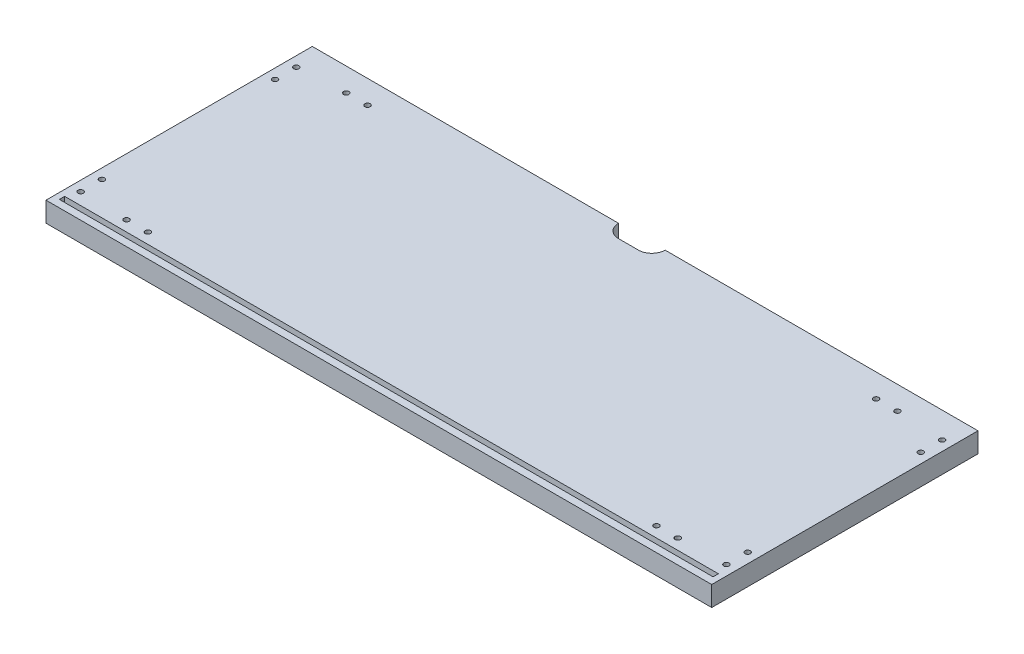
ISO-10303-21;
HEADER;
FILE_DESCRIPTION(('STEP AP214'),'2;1');
FILE_NAME('part.step','',(''),(''),'','','');
FILE_SCHEMA(('AUTOMOTIVE_DESIGN { 1 0 10303 214 1 1 1 1 }'));
ENDSEC;
DATA;
#1=APPLICATION_CONTEXT('core data for automotive mechanical design processes');
#2=APPLICATION_PROTOCOL_DEFINITION('international standard','automotive_design',2000,#1);
#3=PRODUCT_CONTEXT('',#1,'mechanical');
#4=PRODUCT('Part','Part','',(#3));
#5=PRODUCT_RELATED_PRODUCT_CATEGORY('part','',(#4));
#6=PRODUCT_DEFINITION_FORMATION('','',#4);
#7=PRODUCT_DEFINITION_CONTEXT('part definition',#1,'design');
#8=PRODUCT_DEFINITION('design','',#6,#7);
#9=PRODUCT_DEFINITION_SHAPE('','',#8);
#10=(LENGTH_UNIT() NAMED_UNIT(*) SI_UNIT(.MILLI.,.METRE.));
#11=(NAMED_UNIT(*) PLANE_ANGLE_UNIT() SI_UNIT($,.RADIAN.));
#12=(NAMED_UNIT(*) SI_UNIT($,.STERADIAN.) SOLID_ANGLE_UNIT());
#13=UNCERTAINTY_MEASURE_WITH_UNIT(LENGTH_MEASURE(1.E-05),#10,'distance_accuracy_value','');
#14=(GEOMETRIC_REPRESENTATION_CONTEXT(3) GLOBAL_UNCERTAINTY_ASSIGNED_CONTEXT((#13)) GLOBAL_UNIT_ASSIGNED_CONTEXT((#10,
#11,#12)) REPRESENTATION_CONTEXT('',''));
#15=CARTESIAN_POINT('',(0.,0.,0.));
#16=DIRECTION('',(0.,0.,1.));
#17=DIRECTION('',(1.,0.,0.));
#18=AXIS2_PLACEMENT_3D('',#15,#16,#17);
#19=CARTESIAN_POINT('',(-500.,30.,-200.));
#20=DIRECTION('',(0.,0.,1.));
#21=DIRECTION('',(1.,0.,0.));
#22=AXIS2_PLACEMENT_3D('',#19,#20,#21);
#23=PLANE('',#22);
#24=DIRECTION('',(-1.,0.,0.));
#25=VECTOR('',#24,1.);
#26=CARTESIAN_POINT('',(-500.,30.,-200.));
#27=LINE('',#26,#25);
#28=CARTESIAN_POINT('',(-40.,30.,-200.));
#29=VERTEX_POINT('',#28);
#30=CARTESIAN_POINT('',(-500.,30.,-200.));
#31=VERTEX_POINT('',#30);
#32=EDGE_CURVE('E194',#29,#31,#27,.T.);
#33=ORIENTED_EDGE('',*,*,#32,.F.);
#34=DIRECTION('',(0.,1.,0.));
#35=VECTOR('',#34,1.);
#36=CARTESIAN_POINT('',(-40.,0.,-200.));
#37=LINE('',#36,#35);
#38=CARTESIAN_POINT('',(-40.,0.,-200.));
#39=VERTEX_POINT('',#38);
#40=EDGE_CURVE('E154',#39,#29,#37,.T.);
#41=ORIENTED_EDGE('',*,*,#40,.F.);
#42=DIRECTION('',(-1.,0.,0.));
#43=VECTOR('',#42,1.);
#44=CARTESIAN_POINT('',(-500.,0.,-200.));
#45=LINE('',#44,#43);
#46=CARTESIAN_POINT('',(-500.,0.,-200.));
#47=VERTEX_POINT('',#46);
#48=EDGE_CURVE('E141',#39,#47,#45,.T.);
#49=ORIENTED_EDGE('',*,*,#48,.T.);
#50=DIRECTION('',(0.,-1.,0.));
#51=VECTOR('',#50,1.);
#52=CARTESIAN_POINT('',(-500.,30.,-200.));
#53=LINE('',#52,#51);
#54=EDGE_CURVE('E40',#31,#47,#53,.T.);
#55=ORIENTED_EDGE('',*,*,#54,.F.);
#56=EDGE_LOOP('',(#33,#41,#49,#55));
#57=FACE_BOUND('',#56,.T.);
#58=ADVANCED_FACE('F32',(#57),#23,.F.);
#59=CARTESIAN_POINT('',(500.,30.,200.));
#60=DIRECTION('',(-1.,0.,0.));
#61=DIRECTION('',(0.,0.,1.));
#62=AXIS2_PLACEMENT_3D('',#59,#60,#61);
#63=PLANE('',#62);
#64=DIRECTION('',(0.,0.,-1.));
#65=VECTOR('',#64,1.);
#66=CARTESIAN_POINT('',(500.,0.,200.));
#67=LINE('',#66,#65);
#68=CARTESIAN_POINT('',(500.,0.,200.));
#69=VERTEX_POINT('',#68);
#70=CARTESIAN_POINT('',(500.,0.,-200.));
#71=VERTEX_POINT('',#70);
#72=EDGE_CURVE('E185',#69,#71,#67,.T.);
#73=ORIENTED_EDGE('',*,*,#72,.T.);
#74=DIRECTION('',(0.,-1.,0.));
#75=VECTOR('',#74,1.);
#76=CARTESIAN_POINT('',(500.,30.,-200.));
#77=LINE('',#76,#75);
#78=CARTESIAN_POINT('',(500.,30.,-200.));
#79=VERTEX_POINT('',#78);
#80=EDGE_CURVE('E11',#79,#71,#77,.T.);
#81=ORIENTED_EDGE('',*,*,#80,.F.);
#82=DIRECTION('',(0.,0.,-1.));
#83=VECTOR('',#82,1.);
#84=CARTESIAN_POINT('',(500.,30.,200.));
#85=LINE('',#84,#83);
#86=CARTESIAN_POINT('',(500.,30.,200.));
#87=VERTEX_POINT('',#86);
#88=EDGE_CURVE('E191',#87,#79,#85,.T.);
#89=ORIENTED_EDGE('',*,*,#88,.F.);
#90=DIRECTION('',(0.,-1.,0.));
#91=VECTOR('',#90,1.);
#92=CARTESIAN_POINT('',(500.,30.,200.));
#93=LINE('',#92,#91);
#94=EDGE_CURVE('E203',#87,#69,#93,.T.);
#95=ORIENTED_EDGE('',*,*,#94,.T.);
#96=EDGE_LOOP('',(#73,#81,#89,#95));
#97=FACE_BOUND('',#96,.T.);
#98=ADVANCED_FACE('F34',(#97),#63,.F.);
#99=CARTESIAN_POINT('',(30.,0.,-200.));
#100=VERTEX_POINT('',#99);
#101=EDGE_CURVE('E206',#71,#100,#45,.T.);
#102=ORIENTED_EDGE('',*,*,#101,.T.);
#103=DIRECTION('',(0.,1.,0.));
#104=VECTOR('',#103,1.);
#105=CARTESIAN_POINT('',(30.,0.,-200.));
#106=LINE('',#105,#104);
#107=CARTESIAN_POINT('',(30.,30.,-200.));
#108=VERTEX_POINT('',#107);
#109=EDGE_CURVE('E156',#100,#108,#106,.T.);
#110=ORIENTED_EDGE('',*,*,#109,.T.);
#111=EDGE_CURVE('E196',#79,#108,#27,.T.);
#112=ORIENTED_EDGE('',*,*,#111,.F.);
#113=ORIENTED_EDGE('',*,*,#80,.T.);
#114=EDGE_LOOP('',(#102,#110,#112,#113));
#115=FACE_BOUND('',#114,.T.);
#116=ADVANCED_FACE('F237',(#115),#23,.F.);
#117=CARTESIAN_POINT('',(-500.,30.,200.));
#118=DIRECTION('',(1.,0.,0.));
#119=DIRECTION('',(0.,0.,-1.));
#120=AXIS2_PLACEMENT_3D('',#117,#118,#119);
#121=PLANE('',#120);
#122=DIRECTION('',(0.,0.,1.));
#123=VECTOR('',#122,1.);
#124=CARTESIAN_POINT('',(-500.,0.,200.));
#125=LINE('',#124,#123);
#126=CARTESIAN_POINT('',(-500.,0.,200.));
#127=VERTEX_POINT('',#126);
#128=EDGE_CURVE('E209',#47,#127,#125,.T.);
#129=ORIENTED_EDGE('',*,*,#128,.T.);
#130=DIRECTION('',(0.,-1.,0.));
#131=VECTOR('',#130,1.);
#132=CARTESIAN_POINT('',(-500.,30.,200.));
#133=LINE('',#132,#131);
#134=CARTESIAN_POINT('',(-500.,30.,200.));
#135=VERTEX_POINT('',#134);
#136=EDGE_CURVE('E214',#135,#127,#133,.T.);
#137=ORIENTED_EDGE('',*,*,#136,.F.);
#138=DIRECTION('',(0.,0.,1.));
#139=VECTOR('',#138,1.);
#140=CARTESIAN_POINT('',(-500.,30.,200.));
#141=LINE('',#140,#139);
#142=EDGE_CURVE('E199',#31,#135,#141,.T.);
#143=ORIENTED_EDGE('',*,*,#142,.F.);
#144=ORIENTED_EDGE('',*,*,#54,.T.);
#145=EDGE_LOOP('',(#129,#137,#143,#144));
#146=FACE_BOUND('',#145,.T.);
#147=ADVANCED_FACE('F220',(#146),#121,.F.);
#148=CARTESIAN_POINT('',(-500.,30.,200.));
#149=DIRECTION('',(0.,0.,-1.));
#150=DIRECTION('',(-1.,0.,0.));
#151=AXIS2_PLACEMENT_3D('',#148,#149,#150);
#152=PLANE('',#151);
#153=DIRECTION('',(1.,0.,0.));
#154=VECTOR('',#153,1.);
#155=CARTESIAN_POINT('',(-500.,0.,200.));
#156=LINE('',#155,#154);
#157=EDGE_CURVE('E195',#127,#69,#156,.T.);
#158=ORIENTED_EDGE('',*,*,#157,.T.);
#159=ORIENTED_EDGE('',*,*,#94,.F.);
#160=DIRECTION('',(1.,0.,0.));
#161=VECTOR('',#160,1.);
#162=CARTESIAN_POINT('',(-500.,30.,200.));
#163=LINE('',#162,#161);
#164=EDGE_CURVE('E201',#135,#87,#163,.T.);
#165=ORIENTED_EDGE('',*,*,#164,.F.);
#166=ORIENTED_EDGE('',*,*,#136,.T.);
#167=EDGE_LOOP('',(#158,#159,#165,#166));
#168=FACE_BOUND('',#167,.T.);
#169=ADVANCED_FACE('F228',(#168),#152,.F.);
#170=CARTESIAN_POINT('',(0.,30.,0.));
#171=DIRECTION('',(0.,-1.,0.));
#172=DIRECTION('',(0.,0.,-1.));
#173=AXIS2_PLACEMENT_3D('',#170,#171,#172);
#174=PLANE('',#173);
#175=CARTESIAN_POINT('',(485.,30.,163.));
#176=DIRECTION('',(0.,-1.,0.));
#177=DIRECTION('',(0.,0.,1.));
#178=AXIS2_PLACEMENT_3D('',#175,#176,#177);
#179=CIRCLE('',#178,3.99999999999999);
#180=CARTESIAN_POINT('',(485.,30.,167.));
#181=VERTEX_POINT('',#180);
#182=EDGE_CURVE('E580',#181,#181,#179,.T.);
#183=ORIENTED_EDGE('',*,*,#182,.T.);
#184=EDGE_LOOP('',(#183));
#185=FACE_BOUND('',#184,.T.);
#186=CARTESIAN_POINT('',(485.,30.,-129.));
#187=DIRECTION('',(0.,-1.,0.));
#188=DIRECTION('',(0.,0.,1.));
#189=AXIS2_PLACEMENT_3D('',#186,#187,#188);
#190=CIRCLE('',#189,3.99999999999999);
#191=CARTESIAN_POINT('',(485.,30.,-125.));
#192=VERTEX_POINT('',#191);
#193=EDGE_CURVE('E593',#192,#192,#190,.T.);
#194=ORIENTED_EDGE('',*,*,#193,.T.);
#195=EDGE_LOOP('',(#194));
#196=FACE_BOUND('',#195,.T.);
#197=CARTESIAN_POINT('',(485.,30.,-161.));
#198=DIRECTION('',(0.,-1.,0.));
#199=DIRECTION('',(0.,0.,1.));
#200=AXIS2_PLACEMENT_3D('',#197,#198,#199);
#201=CIRCLE('',#200,3.99999999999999);
#202=CARTESIAN_POINT('',(485.,30.,-157.));
#203=VERTEX_POINT('',#202);
#204=EDGE_CURVE('E592',#203,#203,#201,.T.);
#205=ORIENTED_EDGE('',*,*,#204,.T.);
#206=EDGE_LOOP('',(#205));
#207=FACE_BOUND('',#206,.T.);
#208=CARTESIAN_POINT('',(485.,30.,131.));
#209=DIRECTION('',(0.,-1.,0.));
#210=DIRECTION('',(0.,0.,1.));
#211=AXIS2_PLACEMENT_3D('',#208,#209,#210);
#212=CIRCLE('',#211,3.99999999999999);
#213=CARTESIAN_POINT('',(485.,30.,135.));
#214=VERTEX_POINT('',#213);
#215=EDGE_CURVE('E598',#214,#214,#212,.T.);
#216=ORIENTED_EDGE('',*,*,#215,.T.);
#217=EDGE_LOOP('',(#216));
#218=FACE_BOUND('',#217,.T.);
#219=CARTESIAN_POINT('',(382.,30.,-165.));
#220=DIRECTION('',(0.,-1.,0.));
#221=DIRECTION('',(0.,0.,1.));
#222=AXIS2_PLACEMENT_3D('',#219,#220,#221);
#223=CIRCLE('',#222,3.99999999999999);
#224=CARTESIAN_POINT('',(382.,30.,-161.));
#225=VERTEX_POINT('',#224);
#226=EDGE_CURVE('E579',#225,#225,#223,.T.);
#227=ORIENTED_EDGE('',*,*,#226,.T.);
#228=EDGE_LOOP('',(#227));
#229=FACE_BOUND('',#228,.T.);
#230=CARTESIAN_POINT('',(414.,30.,-165.));
#231=DIRECTION('',(0.,-1.,0.));
#232=DIRECTION('',(0.,0.,1.));
#233=AXIS2_PLACEMENT_3D('',#230,#231,#232);
#234=CIRCLE('',#233,3.99999999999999);
#235=CARTESIAN_POINT('',(414.,30.,-161.));
#236=VERTEX_POINT('',#235);
#237=EDGE_CURVE('E616',#236,#236,#234,.T.);
#238=ORIENTED_EDGE('',*,*,#237,.T.);
#239=EDGE_LOOP('',(#238));
#240=FACE_BOUND('',#239,.T.);
#241=CARTESIAN_POINT('',(414.,30.,165.));
#242=DIRECTION('',(0.,-1.,0.));
#243=DIRECTION('',(0.,0.,1.));
#244=AXIS2_PLACEMENT_3D('',#241,#242,#243);
#245=CIRCLE('',#244,3.99999999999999);
#246=CARTESIAN_POINT('',(414.,30.,169.));
#247=VERTEX_POINT('',#246);
#248=EDGE_CURVE('E610',#247,#247,#245,.T.);
#249=ORIENTED_EDGE('',*,*,#248,.T.);
#250=EDGE_LOOP('',(#249));
#251=FACE_BOUND('',#250,.T.);
#252=CARTESIAN_POINT('',(382.,30.,165.));
#253=DIRECTION('',(0.,-1.,0.));
#254=DIRECTION('',(0.,0.,1.));
#255=AXIS2_PLACEMENT_3D('',#252,#253,#254);
#256=CIRCLE('',#255,3.99999999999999);
#257=CARTESIAN_POINT('',(382.,30.,169.));
#258=VERTEX_POINT('',#257);
#259=EDGE_CURVE('E609',#258,#258,#256,.T.);
#260=ORIENTED_EDGE('',*,*,#259,.T.);
#261=EDGE_LOOP('',(#260));
#262=FACE_BOUND('',#261,.T.);
#263=CARTESIAN_POINT('',(-485.,30.,163.));
#264=DIRECTION('',(0.,1.,0.));
#265=DIRECTION('',(0.,0.,1.));
#266=AXIS2_PLACEMENT_3D('',#263,#264,#265);
#267=CIRCLE('',#266,3.99999999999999);
#268=CARTESIAN_POINT('',(-485.,30.,167.));
#269=VERTEX_POINT('',#268);
#270=EDGE_CURVE('E631',#269,#269,#267,.T.);
#271=ORIENTED_EDGE('',*,*,#270,.F.);
#272=EDGE_LOOP('',(#271));
#273=FACE_BOUND('',#272,.T.);
#274=CARTESIAN_POINT('',(-485.,30.,-129.));
#275=DIRECTION('',(0.,1.,0.));
#276=DIRECTION('',(0.,0.,1.));
#277=AXIS2_PLACEMENT_3D('',#274,#275,#276);
#278=CIRCLE('',#277,3.99999999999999);
#279=CARTESIAN_POINT('',(-485.,30.,-125.));
#280=VERTEX_POINT('',#279);
#281=EDGE_CURVE('E624',#280,#280,#278,.T.);
#282=ORIENTED_EDGE('',*,*,#281,.F.);
#283=EDGE_LOOP('',(#282));
#284=FACE_BOUND('',#283,.T.);
#285=CARTESIAN_POINT('',(-485.,30.,-161.));
#286=DIRECTION('',(0.,1.,0.));
#287=DIRECTION('',(0.,0.,1.));
#288=AXIS2_PLACEMENT_3D('',#285,#286,#287);
#289=CIRCLE('',#288,3.99999999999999);
#290=CARTESIAN_POINT('',(-485.,30.,-157.));
#291=VERTEX_POINT('',#290);
#292=EDGE_CURVE('E638',#291,#291,#289,.T.);
#293=ORIENTED_EDGE('',*,*,#292,.F.);
#294=EDGE_LOOP('',(#293));
#295=FACE_BOUND('',#294,.T.);
#296=CARTESIAN_POINT('',(-485.,30.,131.));
#297=DIRECTION('',(0.,1.,0.));
#298=DIRECTION('',(0.,0.,1.));
#299=AXIS2_PLACEMENT_3D('',#296,#297,#298);
#300=CIRCLE('',#299,3.99999999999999);
#301=CARTESIAN_POINT('',(-485.,30.,135.));
#302=VERTEX_POINT('',#301);
#303=EDGE_CURVE('E643',#302,#302,#300,.T.);
#304=ORIENTED_EDGE('',*,*,#303,.F.);
#305=EDGE_LOOP('',(#304));
#306=FACE_BOUND('',#305,.T.);
#307=CARTESIAN_POINT('',(-382.,30.,-165.));
#308=DIRECTION('',(0.,1.,0.));
#309=DIRECTION('',(0.,0.,1.));
#310=AXIS2_PLACEMENT_3D('',#307,#308,#309);
#311=CIRCLE('',#310,3.99999999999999);
#312=CARTESIAN_POINT('',(-382.,30.,-161.));
#313=VERTEX_POINT('',#312);
#314=EDGE_CURVE('E630',#313,#313,#311,.T.);
#315=ORIENTED_EDGE('',*,*,#314,.F.);
#316=EDGE_LOOP('',(#315));
#317=FACE_BOUND('',#316,.T.);
#318=CARTESIAN_POINT('',(-414.,30.,-165.));
#319=DIRECTION('',(0.,1.,0.));
#320=DIRECTION('',(0.,0.,1.));
#321=AXIS2_PLACEMENT_3D('',#318,#319,#320);
#322=CIRCLE('',#321,3.99999999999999);
#323=CARTESIAN_POINT('',(-414.,30.,-161.));
#324=VERTEX_POINT('',#323);
#325=EDGE_CURVE('E660',#324,#324,#322,.T.);
#326=ORIENTED_EDGE('',*,*,#325,.F.);
#327=EDGE_LOOP('',(#326));
#328=FACE_BOUND('',#327,.T.);
#329=CARTESIAN_POINT('',(-414.,30.,165.));
#330=DIRECTION('',(0.,1.,0.));
#331=DIRECTION('',(0.,0.,1.));
#332=AXIS2_PLACEMENT_3D('',#329,#330,#331);
#333=CIRCLE('',#332,3.99999999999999);
#334=CARTESIAN_POINT('',(-414.,30.,169.));
#335=VERTEX_POINT('',#334);
#336=EDGE_CURVE('E654',#335,#335,#333,.T.);
#337=ORIENTED_EDGE('',*,*,#336,.F.);
#338=EDGE_LOOP('',(#337));
#339=FACE_BOUND('',#338,.T.);
#340=CARTESIAN_POINT('',(-382.,30.,165.));
#341=DIRECTION('',(0.,1.,0.));
#342=DIRECTION('',(0.,0.,1.));
#343=AXIS2_PLACEMENT_3D('',#340,#341,#342);
#344=CIRCLE('',#343,3.99999999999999);
#345=CARTESIAN_POINT('',(-382.,30.,169.));
#346=VERTEX_POINT('',#345);
#347=EDGE_CURVE('E147',#346,#346,#344,.T.);
#348=ORIENTED_EDGE('',*,*,#347,.F.);
#349=EDGE_LOOP('',(#348));
#350=FACE_BOUND('',#349,.T.);
#351=DIRECTION('',(1.,0.,0.));
#352=VECTOR('',#351,1.);
#353=CARTESIAN_POINT('',(-491.,30.,189.));
#354=LINE('',#353,#352);
#355=CARTESIAN_POINT('',(-491.,30.,189.));
#356=VERTEX_POINT('',#355);
#357=CARTESIAN_POINT('',(491.,30.,189.));
#358=VERTEX_POINT('',#357);
#359=EDGE_CURVE('E175',#356,#358,#354,.T.);
#360=ORIENTED_EDGE('',*,*,#359,.F.);
#361=DIRECTION('',(0.,0.,1.));
#362=VECTOR('',#361,1.);
#363=CARTESIAN_POINT('',(-491.,30.,181.));
#364=LINE('',#363,#362);
#365=CARTESIAN_POINT('',(-491.,30.,181.));
#366=VERTEX_POINT('',#365);
#367=EDGE_CURVE('E55',#366,#356,#364,.T.);
#368=ORIENTED_EDGE('',*,*,#367,.F.);
#369=DIRECTION('',(-1.,0.,0.));
#370=VECTOR('',#369,1.);
#371=CARTESIAN_POINT('',(-491.,30.,181.));
#372=LINE('',#371,#370);
#373=CARTESIAN_POINT('',(491.,30.,181.));
#374=VERTEX_POINT('',#373);
#375=EDGE_CURVE('E164',#374,#366,#372,.T.);
#376=ORIENTED_EDGE('',*,*,#375,.F.);
#377=DIRECTION('',(0.,0.,-1.));
#378=VECTOR('',#377,1.);
#379=CARTESIAN_POINT('',(491.,30.,181.));
#380=LINE('',#379,#378);
#381=EDGE_CURVE('E178',#358,#374,#380,.T.);
#382=ORIENTED_EDGE('',*,*,#381,.F.);
#383=EDGE_LOOP('',(#360,#368,#376,#382));
#384=FACE_BOUND('',#383,.T.);
#385=DIRECTION('',(1.,0.,0.));
#386=VECTOR('',#385,1.);
#387=CARTESIAN_POINT('',(-20.,30.,-180.));
#388=LINE('',#387,#386);
#389=CARTESIAN_POINT('',(-20.,30.,-180.));
#390=VERTEX_POINT('',#389);
#391=CARTESIAN_POINT('',(10.,30.,-180.));
#392=VERTEX_POINT('',#391);
#393=EDGE_CURVE('E144',#390,#392,#388,.T.);
#394=ORIENTED_EDGE('',*,*,#393,.F.);
#395=CARTESIAN_POINT('',(-20.,30.,-200.));
#396=DIRECTION('',(0.,1.,0.));
#397=DIRECTION('',(0.,0.,1.));
#398=AXIS2_PLACEMENT_3D('',#395,#396,#397);
#399=CIRCLE('',#398,20.);
#400=EDGE_CURVE('E127',#29,#390,#399,.T.);
#401=ORIENTED_EDGE('',*,*,#400,.F.);
#402=ORIENTED_EDGE('',*,*,#32,.T.);
#403=ORIENTED_EDGE('',*,*,#142,.T.);
#404=ORIENTED_EDGE('',*,*,#164,.T.);
#405=ORIENTED_EDGE('',*,*,#88,.T.);
#406=ORIENTED_EDGE('',*,*,#111,.T.);
#407=CARTESIAN_POINT('',(10.,30.,-200.));
#408=DIRECTION('',(0.,1.,0.));
#409=DIRECTION('',(0.,0.,1.));
#410=AXIS2_PLACEMENT_3D('',#407,#408,#409);
#411=CIRCLE('',#410,20.);
#412=EDGE_CURVE('E142',#392,#108,#411,.T.);
#413=ORIENTED_EDGE('',*,*,#412,.F.);
#414=EDGE_LOOP('',(#394,#401,#402,#403,#404,#405,#406,#413));
#415=FACE_BOUND('',#414,.T.);
#416=ADVANCED_FACE('F234',(#185,#196,#207,#218,#229,#240,#251,#262,#273,#284,#295,#306,#317,
#328,#339,#350,#384,#415),#174,.F.);
#417=CARTESIAN_POINT('',(0.,0.,0.));
#418=DIRECTION('',(0.,-1.,0.));
#419=DIRECTION('',(0.,0.,-1.));
#420=AXIS2_PLACEMENT_3D('',#417,#418,#419);
#421=PLANE('',#420);
#422=CARTESIAN_POINT('',(382.,0.,-165.));
#423=DIRECTION('',(0.,-1.,0.));
#424=DIRECTION('',(0.,0.,1.));
#425=AXIS2_PLACEMENT_3D('',#422,#423,#424);
#426=CIRCLE('',#425,3.99999999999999);
#427=CARTESIAN_POINT('',(382.,0.,-161.));
#428=VERTEX_POINT('',#427);
#429=EDGE_CURVE('E583',#428,#428,#426,.T.);
#430=ORIENTED_EDGE('',*,*,#429,.F.);
#431=EDGE_LOOP('',(#430));
#432=FACE_BOUND('',#431,.T.);
#433=CARTESIAN_POINT('',(414.,0.,-165.));
#434=DIRECTION('',(0.,-1.,0.));
#435=DIRECTION('',(0.,0.,1.));
#436=AXIS2_PLACEMENT_3D('',#433,#434,#435);
#437=CIRCLE('',#436,3.99999999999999);
#438=CARTESIAN_POINT('',(414.,0.,-161.));
#439=VERTEX_POINT('',#438);
#440=EDGE_CURVE('E613',#439,#439,#437,.T.);
#441=ORIENTED_EDGE('',*,*,#440,.F.);
#442=EDGE_LOOP('',(#441));
#443=FACE_BOUND('',#442,.T.);
#444=CARTESIAN_POINT('',(414.,0.,165.));
#445=DIRECTION('',(0.,-1.,0.));
#446=DIRECTION('',(0.,0.,1.));
#447=AXIS2_PLACEMENT_3D('',#444,#445,#446);
#448=CIRCLE('',#447,3.99999999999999);
#449=CARTESIAN_POINT('',(414.,0.,169.));
#450=VERTEX_POINT('',#449);
#451=EDGE_CURVE('E606',#450,#450,#448,.T.);
#452=ORIENTED_EDGE('',*,*,#451,.F.);
#453=EDGE_LOOP('',(#452));
#454=FACE_BOUND('',#453,.T.);
#455=CARTESIAN_POINT('',(382.,0.,165.));
#456=DIRECTION('',(0.,-1.,0.));
#457=DIRECTION('',(0.,0.,1.));
#458=AXIS2_PLACEMENT_3D('',#455,#456,#457);
#459=CIRCLE('',#458,3.99999999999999);
#460=CARTESIAN_POINT('',(382.,0.,169.));
#461=VERTEX_POINT('',#460);
#462=EDGE_CURVE('E621',#461,#461,#459,.T.);
#463=ORIENTED_EDGE('',*,*,#462,.F.);
#464=EDGE_LOOP('',(#463));
#465=FACE_BOUND('',#464,.T.);
#466=CARTESIAN_POINT('',(-382.,0.,-165.));
#467=DIRECTION('',(0.,1.,0.));
#468=DIRECTION('',(0.,0.,1.));
#469=AXIS2_PLACEMENT_3D('',#466,#467,#468);
#470=CIRCLE('',#469,3.99999999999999);
#471=CARTESIAN_POINT('',(-382.,0.,-161.));
#472=VERTEX_POINT('',#471);
#473=EDGE_CURVE('E663',#472,#472,#470,.T.);
#474=ORIENTED_EDGE('',*,*,#473,.T.);
#475=EDGE_LOOP('',(#474));
#476=FACE_BOUND('',#475,.T.);
#477=CARTESIAN_POINT('',(-414.,0.,-165.));
#478=DIRECTION('',(0.,1.,0.));
#479=DIRECTION('',(0.,0.,1.));
#480=AXIS2_PLACEMENT_3D('',#477,#478,#479);
#481=CIRCLE('',#480,3.99999999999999);
#482=CARTESIAN_POINT('',(-414.,0.,-161.));
#483=VERTEX_POINT('',#482);
#484=EDGE_CURVE('E657',#483,#483,#481,.T.);
#485=ORIENTED_EDGE('',*,*,#484,.T.);
#486=EDGE_LOOP('',(#485));
#487=FACE_BOUND('',#486,.T.);
#488=CARTESIAN_POINT('',(-414.,0.,165.));
#489=DIRECTION('',(0.,1.,0.));
#490=DIRECTION('',(0.,0.,1.));
#491=AXIS2_PLACEMENT_3D('',#488,#489,#490);
#492=CIRCLE('',#491,3.99999999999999);
#493=CARTESIAN_POINT('',(-414.,0.,169.));
#494=VERTEX_POINT('',#493);
#495=EDGE_CURVE('E651',#494,#494,#492,.T.);
#496=ORIENTED_EDGE('',*,*,#495,.T.);
#497=EDGE_LOOP('',(#496));
#498=FACE_BOUND('',#497,.T.);
#499=CARTESIAN_POINT('',(-382.,0.,165.));
#500=DIRECTION('',(0.,1.,0.));
#501=DIRECTION('',(0.,0.,1.));
#502=AXIS2_PLACEMENT_3D('',#499,#500,#501);
#503=CIRCLE('',#502,3.99999999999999);
#504=CARTESIAN_POINT('',(-382.,0.,169.));
#505=VERTEX_POINT('',#504);
#506=EDGE_CURVE('E152',#505,#505,#503,.T.);
#507=ORIENTED_EDGE('',*,*,#506,.T.);
#508=EDGE_LOOP('',(#507));
#509=FACE_BOUND('',#508,.T.);
#510=CARTESIAN_POINT('',(-20.,0.,-200.));
#511=DIRECTION('',(0.,1.,0.));
#512=DIRECTION('',(0.,0.,1.));
#513=AXIS2_PLACEMENT_3D('',#510,#511,#512);
#514=CIRCLE('',#513,20.);
#515=CARTESIAN_POINT('',(-20.,0.,-180.));
#516=VERTEX_POINT('',#515);
#517=EDGE_CURVE('E124',#39,#516,#514,.T.);
#518=ORIENTED_EDGE('',*,*,#517,.T.);
#519=DIRECTION('',(1.,0.,0.));
#520=VECTOR('',#519,1.);
#521=CARTESIAN_POINT('',(-20.,0.,-180.));
#522=LINE('',#521,#520);
#523=CARTESIAN_POINT('',(10.,0.,-180.));
#524=VERTEX_POINT('',#523);
#525=EDGE_CURVE('E134',#516,#524,#522,.T.);
#526=ORIENTED_EDGE('',*,*,#525,.T.);
#527=CARTESIAN_POINT('',(10.,0.,-200.));
#528=DIRECTION('',(0.,1.,0.));
#529=DIRECTION('',(0.,0.,1.));
#530=AXIS2_PLACEMENT_3D('',#527,#528,#529);
#531=CIRCLE('',#530,20.);
#532=EDGE_CURVE('E47',#524,#100,#531,.T.);
#533=ORIENTED_EDGE('',*,*,#532,.T.);
#534=ORIENTED_EDGE('',*,*,#101,.F.);
#535=ORIENTED_EDGE('',*,*,#72,.F.);
#536=ORIENTED_EDGE('',*,*,#157,.F.);
#537=ORIENTED_EDGE('',*,*,#128,.F.);
#538=ORIENTED_EDGE('',*,*,#48,.F.);
#539=EDGE_LOOP('',(#518,#526,#533,#534,#535,#536,#537,#538));
#540=FACE_BOUND('',#539,.T.);
#541=ADVANCED_FACE('F139',(#432,#443,#454,#465,#476,#487,#498,#509,#540),#421,.T.);
#542=CARTESIAN_POINT('',(-491.,21.,181.));
#543=DIRECTION('',(-1.,0.,0.));
#544=DIRECTION('',(0.,0.,1.));
#545=AXIS2_PLACEMENT_3D('',#542,#543,#544);
#546=PLANE('',#545);
#547=ORIENTED_EDGE('',*,*,#367,.T.);
#548=DIRECTION('',(0.,1.,0.));
#549=VECTOR('',#548,1.);
#550=CARTESIAN_POINT('',(-491.,21.,189.));
#551=LINE('',#550,#549);
#552=CARTESIAN_POINT('',(-491.,21.,189.));
#553=VERTEX_POINT('',#552);
#554=EDGE_CURVE('E173',#553,#356,#551,.T.);
#555=ORIENTED_EDGE('',*,*,#554,.F.);
#556=DIRECTION('',(0.,0.,1.));
#557=VECTOR('',#556,1.);
#558=CARTESIAN_POINT('',(-491.,21.,181.));
#559=LINE('',#558,#557);
#560=CARTESIAN_POINT('',(-491.,21.,181.));
#561=VERTEX_POINT('',#560);
#562=EDGE_CURVE('E160',#561,#553,#559,.T.);
#563=ORIENTED_EDGE('',*,*,#562,.F.);
#564=DIRECTION('',(0.,1.,0.));
#565=VECTOR('',#564,1.);
#566=CARTESIAN_POINT('',(-491.,21.,181.));
#567=LINE('',#566,#565);
#568=EDGE_CURVE('E183',#561,#366,#567,.T.);
#569=ORIENTED_EDGE('',*,*,#568,.T.);
#570=EDGE_LOOP('',(#547,#555,#563,#569));
#571=FACE_BOUND('',#570,.T.);
#572=ADVANCED_FACE('F269',(#571),#546,.F.);
#573=CARTESIAN_POINT('',(-491.,21.,181.));
#574=DIRECTION('',(0.,0.,-1.));
#575=DIRECTION('',(-1.,0.,0.));
#576=AXIS2_PLACEMENT_3D('',#573,#574,#575);
#577=PLANE('',#576);
#578=ORIENTED_EDGE('',*,*,#375,.T.);
#579=ORIENTED_EDGE('',*,*,#568,.F.);
#580=DIRECTION('',(-1.,0.,0.));
#581=VECTOR('',#580,1.);
#582=CARTESIAN_POINT('',(-491.,21.,181.));
#583=LINE('',#582,#581);
#584=CARTESIAN_POINT('',(491.,21.,181.));
#585=VERTEX_POINT('',#584);
#586=EDGE_CURVE('E170',#585,#561,#583,.T.);
#587=ORIENTED_EDGE('',*,*,#586,.F.);
#588=DIRECTION('',(0.,1.,0.));
#589=VECTOR('',#588,1.);
#590=CARTESIAN_POINT('',(491.,21.,181.));
#591=LINE('',#590,#589);
#592=EDGE_CURVE('E186',#585,#374,#591,.T.);
#593=ORIENTED_EDGE('',*,*,#592,.T.);
#594=EDGE_LOOP('',(#578,#579,#587,#593));
#595=FACE_BOUND('',#594,.T.);
#596=ADVANCED_FACE('F265',(#595),#577,.F.);
#597=CARTESIAN_POINT('',(491.,21.,181.));
#598=DIRECTION('',(1.,0.,0.));
#599=DIRECTION('',(0.,0.,-1.));
#600=AXIS2_PLACEMENT_3D('',#597,#598,#599);
#601=PLANE('',#600);
#602=ORIENTED_EDGE('',*,*,#381,.T.);
#603=ORIENTED_EDGE('',*,*,#592,.F.);
#604=DIRECTION('',(0.,0.,-1.));
#605=VECTOR('',#604,1.);
#606=CARTESIAN_POINT('',(491.,21.,181.));
#607=LINE('',#606,#605);
#608=CARTESIAN_POINT('',(491.,21.,189.));
#609=VERTEX_POINT('',#608);
#610=EDGE_CURVE('E167',#609,#585,#607,.T.);
#611=ORIENTED_EDGE('',*,*,#610,.F.);
#612=DIRECTION('',(0.,1.,0.));
#613=VECTOR('',#612,1.);
#614=CARTESIAN_POINT('',(491.,21.,189.));
#615=LINE('',#614,#613);
#616=EDGE_CURVE('E188',#609,#358,#615,.T.);
#617=ORIENTED_EDGE('',*,*,#616,.T.);
#618=EDGE_LOOP('',(#602,#603,#611,#617));
#619=FACE_BOUND('',#618,.T.);
#620=ADVANCED_FACE('F268',(#619),#601,.F.);
#621=CARTESIAN_POINT('',(-491.,21.,189.));
#622=DIRECTION('',(0.,0.,1.));
#623=DIRECTION('',(1.,0.,0.));
#624=AXIS2_PLACEMENT_3D('',#621,#622,#623);
#625=PLANE('',#624);
#626=ORIENTED_EDGE('',*,*,#359,.T.);
#627=ORIENTED_EDGE('',*,*,#616,.F.);
#628=DIRECTION('',(1.,0.,0.));
#629=VECTOR('',#628,1.);
#630=CARTESIAN_POINT('',(-491.,21.,189.));
#631=LINE('',#630,#629);
#632=EDGE_CURVE('E163',#553,#609,#631,.T.);
#633=ORIENTED_EDGE('',*,*,#632,.F.);
#634=ORIENTED_EDGE('',*,*,#554,.T.);
#635=EDGE_LOOP('',(#626,#627,#633,#634));
#636=FACE_BOUND('',#635,.T.);
#637=ADVANCED_FACE('F263',(#636),#625,.F.);
#638=CARTESIAN_POINT('',(0.,21.,0.));
#639=DIRECTION('',(0.,1.,0.));
#640=DIRECTION('',(0.,0.,1.));
#641=AXIS2_PLACEMENT_3D('',#638,#639,#640);
#642=PLANE('',#641);
#643=ORIENTED_EDGE('',*,*,#562,.T.);
#644=ORIENTED_EDGE('',*,*,#632,.T.);
#645=ORIENTED_EDGE('',*,*,#610,.T.);
#646=ORIENTED_EDGE('',*,*,#586,.T.);
#647=EDGE_LOOP('',(#643,#644,#645,#646));
#648=FACE_BOUND('',#647,.T.);
#649=ADVANCED_FACE('F256',(#648),#642,.T.);
#650=CARTESIAN_POINT('',(-20.,0.,-200.));
#651=DIRECTION('',(0.,1.,0.));
#652=DIRECTION('',(0.,0.,1.));
#653=AXIS2_PLACEMENT_3D('',#650,#651,#652);
#654=CYLINDRICAL_SURFACE('',#653,20.);
#655=ORIENTED_EDGE('',*,*,#400,.T.);
#656=DIRECTION('',(0.,1.,0.));
#657=VECTOR('',#656,1.);
#658=CARTESIAN_POINT('',(-20.,0.,-180.));
#659=LINE('',#658,#657);
#660=EDGE_CURVE('E120',#516,#390,#659,.T.);
#661=ORIENTED_EDGE('',*,*,#660,.F.);
#662=ORIENTED_EDGE('',*,*,#517,.F.);
#663=ORIENTED_EDGE('',*,*,#40,.T.);
#664=EDGE_LOOP('',(#655,#661,#662,#663));
#665=FACE_BOUND('',#664,.T.);
#666=ADVANCED_FACE('F122',(#665),#654,.F.);
#667=CARTESIAN_POINT('',(10.,0.,-200.));
#668=DIRECTION('',(0.,1.,0.));
#669=DIRECTION('',(0.,0.,1.));
#670=AXIS2_PLACEMENT_3D('',#667,#668,#669);
#671=CYLINDRICAL_SURFACE('',#670,20.);
#672=ORIENTED_EDGE('',*,*,#412,.T.);
#673=ORIENTED_EDGE('',*,*,#109,.F.);
#674=ORIENTED_EDGE('',*,*,#532,.F.);
#675=DIRECTION('',(0.,1.,0.));
#676=VECTOR('',#675,1.);
#677=CARTESIAN_POINT('',(10.,0.,-180.));
#678=LINE('',#677,#676);
#679=EDGE_CURVE('E131',#524,#392,#678,.T.);
#680=ORIENTED_EDGE('',*,*,#679,.T.);
#681=EDGE_LOOP('',(#672,#673,#674,#680));
#682=FACE_BOUND('',#681,.T.);
#683=ADVANCED_FACE('F247',(#682),#671,.F.);
#684=CARTESIAN_POINT('',(-20.,0.,-180.));
#685=DIRECTION('',(0.,0.,1.));
#686=DIRECTION('',(1.,0.,0.));
#687=AXIS2_PLACEMENT_3D('',#684,#685,#686);
#688=PLANE('',#687);
#689=ORIENTED_EDGE('',*,*,#393,.T.);
#690=ORIENTED_EDGE('',*,*,#679,.F.);
#691=ORIENTED_EDGE('',*,*,#525,.F.);
#692=ORIENTED_EDGE('',*,*,#660,.T.);
#693=EDGE_LOOP('',(#689,#690,#691,#692));
#694=FACE_BOUND('',#693,.T.);
#695=ADVANCED_FACE('F135',(#694),#688,.F.);
#696=CARTESIAN_POINT('',(-382.,0.,165.));
#697=DIRECTION('',(0.,1.,0.));
#698=DIRECTION('',(0.,0.,1.));
#699=AXIS2_PLACEMENT_3D('',#696,#697,#698);
#700=CYLINDRICAL_SURFACE('',#699,3.99999999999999);
#701=ORIENTED_EDGE('',*,*,#506,.F.);
#702=EDGE_LOOP('',(#701));
#703=FACE_BOUND('',#702,.T.);
#704=ORIENTED_EDGE('',*,*,#347,.T.);
#705=EDGE_LOOP('',(#704));
#706=FACE_BOUND('',#705,.T.);
#707=ADVANCED_FACE('F254',(#703,#706),#700,.F.);
#708=CARTESIAN_POINT('',(-414.,0.,165.));
#709=DIRECTION('',(0.,1.,0.));
#710=DIRECTION('',(0.,0.,1.));
#711=AXIS2_PLACEMENT_3D('',#708,#709,#710);
#712=CYLINDRICAL_SURFACE('',#711,3.99999999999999);
#713=ORIENTED_EDGE('',*,*,#495,.F.);
#714=EDGE_LOOP('',(#713));
#715=FACE_BOUND('',#714,.T.);
#716=ORIENTED_EDGE('',*,*,#336,.T.);
#717=EDGE_LOOP('',(#716));
#718=FACE_BOUND('',#717,.T.);
#719=ADVANCED_FACE('F346',(#715,#718),#712,.F.);
#720=CARTESIAN_POINT('',(-414.,0.,-165.));
#721=DIRECTION('',(0.,1.,0.));
#722=DIRECTION('',(0.,0.,1.));
#723=AXIS2_PLACEMENT_3D('',#720,#721,#722);
#724=CYLINDRICAL_SURFACE('',#723,3.99999999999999);
#725=ORIENTED_EDGE('',*,*,#484,.F.);
#726=EDGE_LOOP('',(#725));
#727=FACE_BOUND('',#726,.T.);
#728=ORIENTED_EDGE('',*,*,#325,.T.);
#729=EDGE_LOOP('',(#728));
#730=FACE_BOUND('',#729,.T.);
#731=ADVANCED_FACE('F355',(#727,#730),#724,.F.);
#732=CARTESIAN_POINT('',(-382.,0.,-165.));
#733=DIRECTION('',(0.,1.,0.));
#734=DIRECTION('',(0.,0.,1.));
#735=AXIS2_PLACEMENT_3D('',#732,#733,#734);
#736=CYLINDRICAL_SURFACE('',#735,3.99999999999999);
#737=ORIENTED_EDGE('',*,*,#473,.F.);
#738=EDGE_LOOP('',(#737));
#739=FACE_BOUND('',#738,.T.);
#740=ORIENTED_EDGE('',*,*,#314,.T.);
#741=EDGE_LOOP('',(#740));
#742=FACE_BOUND('',#741,.T.);
#743=ADVANCED_FACE('F365',(#739,#742),#736,.F.);
#744=CARTESIAN_POINT('',(-485.,21.,131.));
#745=DIRECTION('',(0.,1.,0.));
#746=DIRECTION('',(0.,0.,1.));
#747=AXIS2_PLACEMENT_3D('',#744,#745,#746);
#748=CYLINDRICAL_SURFACE('',#747,3.99999999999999);
#749=CARTESIAN_POINT('',(-485.,21.,131.));
#750=DIRECTION('',(0.,1.,0.));
#751=DIRECTION('',(0.,0.,1.));
#752=AXIS2_PLACEMENT_3D('',#749,#750,#751);
#753=CIRCLE('',#752,3.99999999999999);
#754=CARTESIAN_POINT('',(-485.,21.,135.));
#755=VERTEX_POINT('',#754);
#756=EDGE_CURVE('E634',#755,#755,#753,.T.);
#757=ORIENTED_EDGE('',*,*,#756,.F.);
#758=EDGE_LOOP('',(#757));
#759=FACE_BOUND('',#758,.T.);
#760=ORIENTED_EDGE('',*,*,#303,.T.);
#761=EDGE_LOOP('',(#760));
#762=FACE_BOUND('',#761,.T.);
#763=ADVANCED_FACE('F375',(#759,#762),#748,.F.);
#764=CARTESIAN_POINT('',(-485.,21.,131.));
#765=DIRECTION('',(0.,1.,0.));
#766=DIRECTION('',(0.,0.,1.));
#767=AXIS2_PLACEMENT_3D('',#764,#765,#766);
#768=PLANE('',#767);
#769=ORIENTED_EDGE('',*,*,#756,.T.);
#770=EDGE_LOOP('',(#769));
#771=FACE_BOUND('',#770,.T.);
#772=ADVANCED_FACE('F384',(#771),#768,.T.);
#773=CARTESIAN_POINT('',(-485.,21.,-161.));
#774=DIRECTION('',(0.,1.,0.));
#775=DIRECTION('',(0.,0.,1.));
#776=AXIS2_PLACEMENT_3D('',#773,#774,#775);
#777=CYLINDRICAL_SURFACE('',#776,3.99999999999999);
#778=CARTESIAN_POINT('',(-485.,21.,-161.));
#779=DIRECTION('',(0.,1.,0.));
#780=DIRECTION('',(0.,0.,1.));
#781=AXIS2_PLACEMENT_3D('',#778,#779,#780);
#782=CIRCLE('',#781,3.99999999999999);
#783=CARTESIAN_POINT('',(-485.,21.,-157.));
#784=VERTEX_POINT('',#783);
#785=EDGE_CURVE('E646',#784,#784,#782,.T.);
#786=ORIENTED_EDGE('',*,*,#785,.F.);
#787=EDGE_LOOP('',(#786));
#788=FACE_BOUND('',#787,.T.);
#789=ORIENTED_EDGE('',*,*,#292,.T.);
#790=EDGE_LOOP('',(#789));
#791=FACE_BOUND('',#790,.T.);
#792=ADVANCED_FACE('F394',(#788,#791),#777,.F.);
#793=CARTESIAN_POINT('',(-485.,21.,-161.));
#794=DIRECTION('',(0.,1.,0.));
#795=DIRECTION('',(0.,0.,1.));
#796=AXIS2_PLACEMENT_3D('',#793,#794,#795);
#797=PLANE('',#796);
#798=ORIENTED_EDGE('',*,*,#785,.T.);
#799=EDGE_LOOP('',(#798));
#800=FACE_BOUND('',#799,.T.);
#801=ADVANCED_FACE('F404',(#800),#797,.T.);
#802=CARTESIAN_POINT('',(-485.,21.,-129.));
#803=DIRECTION('',(0.,1.,0.));
#804=DIRECTION('',(0.,0.,1.));
#805=AXIS2_PLACEMENT_3D('',#802,#803,#804);
#806=CYLINDRICAL_SURFACE('',#805,3.99999999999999);
#807=CARTESIAN_POINT('',(-485.,21.,-129.));
#808=DIRECTION('',(0.,1.,0.));
#809=DIRECTION('',(0.,0.,1.));
#810=AXIS2_PLACEMENT_3D('',#807,#808,#809);
#811=CIRCLE('',#810,3.99999999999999);
#812=CARTESIAN_POINT('',(-485.,21.,-125.));
#813=VERTEX_POINT('',#812);
#814=EDGE_CURVE('E635',#813,#813,#811,.T.);
#815=ORIENTED_EDGE('',*,*,#814,.F.);
#816=EDGE_LOOP('',(#815));
#817=FACE_BOUND('',#816,.T.);
#818=ORIENTED_EDGE('',*,*,#281,.T.);
#819=EDGE_LOOP('',(#818));
#820=FACE_BOUND('',#819,.T.);
#821=ADVANCED_FACE('F414',(#817,#820),#806,.F.);
#822=CARTESIAN_POINT('',(-485.,21.,-129.));
#823=DIRECTION('',(0.,1.,0.));
#824=DIRECTION('',(0.,0.,1.));
#825=AXIS2_PLACEMENT_3D('',#822,#823,#824);
#826=PLANE('',#825);
#827=ORIENTED_EDGE('',*,*,#814,.T.);
#828=EDGE_LOOP('',(#827));
#829=FACE_BOUND('',#828,.T.);
#830=ADVANCED_FACE('F424',(#829),#826,.T.);
#831=CARTESIAN_POINT('',(-485.,21.,163.));
#832=DIRECTION('',(0.,1.,0.));
#833=DIRECTION('',(0.,0.,1.));
#834=AXIS2_PLACEMENT_3D('',#831,#832,#833);
#835=CYLINDRICAL_SURFACE('',#834,3.99999999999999);
#836=CARTESIAN_POINT('',(-485.,21.,163.));
#837=DIRECTION('',(0.,1.,0.));
#838=DIRECTION('',(0.,0.,1.));
#839=AXIS2_PLACEMENT_3D('',#836,#837,#838);
#840=CIRCLE('',#839,3.99999999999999);
#841=CARTESIAN_POINT('',(-485.,21.,167.));
#842=VERTEX_POINT('',#841);
#843=EDGE_CURVE('E627',#842,#842,#840,.T.);
#844=ORIENTED_EDGE('',*,*,#843,.F.);
#845=EDGE_LOOP('',(#844));
#846=FACE_BOUND('',#845,.T.);
#847=ORIENTED_EDGE('',*,*,#270,.T.);
#848=EDGE_LOOP('',(#847));
#849=FACE_BOUND('',#848,.T.);
#850=ADVANCED_FACE('F434',(#846,#849),#835,.F.);
#851=CARTESIAN_POINT('',(-485.,21.,163.));
#852=DIRECTION('',(0.,1.,0.));
#853=DIRECTION('',(0.,0.,1.));
#854=AXIS2_PLACEMENT_3D('',#851,#852,#853);
#855=PLANE('',#854);
#856=ORIENTED_EDGE('',*,*,#843,.T.);
#857=EDGE_LOOP('',(#856));
#858=FACE_BOUND('',#857,.T.);
#859=ADVANCED_FACE('F443',(#858),#855,.T.);
#860=CARTESIAN_POINT('',(382.,0.,165.));
#861=DIRECTION('',(0.,1.,0.));
#862=DIRECTION('',(0.,0.,1.));
#863=AXIS2_PLACEMENT_3D('',#860,#861,#862);
#864=CYLINDRICAL_SURFACE('',#863,3.99999999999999);
#865=ORIENTED_EDGE('',*,*,#462,.T.);
#866=EDGE_LOOP('',(#865));
#867=FACE_BOUND('',#866,.T.);
#868=ORIENTED_EDGE('',*,*,#259,.F.);
#869=EDGE_LOOP('',(#868));
#870=FACE_BOUND('',#869,.T.);
#871=ADVANCED_FACE('F452',(#867,#870),#864,.F.);
#872=CARTESIAN_POINT('',(414.,0.,165.));
#873=DIRECTION('',(0.,1.,0.));
#874=DIRECTION('',(0.,0.,1.));
#875=AXIS2_PLACEMENT_3D('',#872,#873,#874);
#876=CYLINDRICAL_SURFACE('',#875,3.99999999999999);
#877=ORIENTED_EDGE('',*,*,#451,.T.);
#878=EDGE_LOOP('',(#877));
#879=FACE_BOUND('',#878,.T.);
#880=ORIENTED_EDGE('',*,*,#248,.F.);
#881=EDGE_LOOP('',(#880));
#882=FACE_BOUND('',#881,.T.);
#883=ADVANCED_FACE('F462',(#879,#882),#876,.F.);
#884=CARTESIAN_POINT('',(414.,0.,-165.));
#885=DIRECTION('',(0.,1.,0.));
#886=DIRECTION('',(0.,0.,1.));
#887=AXIS2_PLACEMENT_3D('',#884,#885,#886);
#888=CYLINDRICAL_SURFACE('',#887,3.99999999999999);
#889=ORIENTED_EDGE('',*,*,#440,.T.);
#890=EDGE_LOOP('',(#889));
#891=FACE_BOUND('',#890,.T.);
#892=ORIENTED_EDGE('',*,*,#237,.F.);
#893=EDGE_LOOP('',(#892));
#894=FACE_BOUND('',#893,.T.);
#895=ADVANCED_FACE('F469',(#891,#894),#888,.F.);
#896=CARTESIAN_POINT('',(382.,0.,-165.));
#897=DIRECTION('',(0.,1.,0.));
#898=DIRECTION('',(0.,0.,1.));
#899=AXIS2_PLACEMENT_3D('',#896,#897,#898);
#900=CYLINDRICAL_SURFACE('',#899,3.99999999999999);
#901=ORIENTED_EDGE('',*,*,#429,.T.);
#902=EDGE_LOOP('',(#901));
#903=FACE_BOUND('',#902,.T.);
#904=ORIENTED_EDGE('',*,*,#226,.F.);
#905=EDGE_LOOP('',(#904));
#906=FACE_BOUND('',#905,.T.);
#907=ADVANCED_FACE('F477',(#903,#906),#900,.F.);
#908=CARTESIAN_POINT('',(485.,21.,131.));
#909=DIRECTION('',(0.,1.,0.));
#910=DIRECTION('',(0.,0.,1.));
#911=AXIS2_PLACEMENT_3D('',#908,#909,#910);
#912=CYLINDRICAL_SURFACE('',#911,3.99999999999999);
#913=CARTESIAN_POINT('',(485.,21.,131.));
#914=DIRECTION('',(0.,-1.,0.));
#915=DIRECTION('',(0.,0.,1.));
#916=AXIS2_PLACEMENT_3D('',#913,#914,#915);
#917=CIRCLE('',#916,3.99999999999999);
#918=CARTESIAN_POINT('',(485.,21.,135.));
#919=VERTEX_POINT('',#918);
#920=EDGE_CURVE('E586',#919,#919,#917,.T.);
#921=ORIENTED_EDGE('',*,*,#920,.T.);
#922=EDGE_LOOP('',(#921));
#923=FACE_BOUND('',#922,.T.);
#924=ORIENTED_EDGE('',*,*,#215,.F.);
#925=EDGE_LOOP('',(#924));
#926=FACE_BOUND('',#925,.T.);
#927=ADVANCED_FACE('F485',(#923,#926),#912,.F.);
#928=CARTESIAN_POINT('',(485.,21.,131.));
#929=DIRECTION('',(0.,1.,0.));
#930=DIRECTION('',(0.,0.,1.));
#931=AXIS2_PLACEMENT_3D('',#928,#929,#930);
#932=PLANE('',#931);
#933=ORIENTED_EDGE('',*,*,#920,.F.);
#934=EDGE_LOOP('',(#933));
#935=FACE_BOUND('',#934,.T.);
#936=ADVANCED_FACE('F493',(#935),#932,.T.);
#937=CARTESIAN_POINT('',(485.,21.,-161.));
#938=DIRECTION('',(0.,1.,0.));
#939=DIRECTION('',(0.,0.,1.));
#940=AXIS2_PLACEMENT_3D('',#937,#938,#939);
#941=CYLINDRICAL_SURFACE('',#940,3.99999999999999);
#942=CARTESIAN_POINT('',(485.,21.,-161.));
#943=DIRECTION('',(0.,-1.,0.));
#944=DIRECTION('',(0.,0.,1.));
#945=AXIS2_PLACEMENT_3D('',#942,#943,#944);
#946=CIRCLE('',#945,3.99999999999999);
#947=CARTESIAN_POINT('',(485.,21.,-157.));
#948=VERTEX_POINT('',#947);
#949=EDGE_CURVE('E601',#948,#948,#946,.T.);
#950=ORIENTED_EDGE('',*,*,#949,.T.);
#951=EDGE_LOOP('',(#950));
#952=FACE_BOUND('',#951,.T.);
#953=ORIENTED_EDGE('',*,*,#204,.F.);
#954=EDGE_LOOP('',(#953));
#955=FACE_BOUND('',#954,.T.);
#956=ADVANCED_FACE('F501',(#952,#955),#941,.F.);
#957=CARTESIAN_POINT('',(485.,21.,-161.));
#958=DIRECTION('',(0.,1.,0.));
#959=DIRECTION('',(0.,0.,1.));
#960=AXIS2_PLACEMENT_3D('',#957,#958,#959);
#961=PLANE('',#960);
#962=ORIENTED_EDGE('',*,*,#949,.F.);
#963=EDGE_LOOP('',(#962));
#964=FACE_BOUND('',#963,.T.);
#965=ADVANCED_FACE('F509',(#964),#961,.T.);
#966=CARTESIAN_POINT('',(485.,21.,-129.));
#967=DIRECTION('',(0.,1.,0.));
#968=DIRECTION('',(0.,0.,1.));
#969=AXIS2_PLACEMENT_3D('',#966,#967,#968);
#970=CYLINDRICAL_SURFACE('',#969,3.99999999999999);
#971=CARTESIAN_POINT('',(485.,21.,-129.));
#972=DIRECTION('',(0.,-1.,0.));
#973=DIRECTION('',(0.,0.,1.));
#974=AXIS2_PLACEMENT_3D('',#971,#972,#973);
#975=CIRCLE('',#974,3.99999999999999);
#976=CARTESIAN_POINT('',(485.,21.,-125.));
#977=VERTEX_POINT('',#976);
#978=EDGE_CURVE('E589',#977,#977,#975,.T.);
#979=ORIENTED_EDGE('',*,*,#978,.T.);
#980=EDGE_LOOP('',(#979));
#981=FACE_BOUND('',#980,.T.);
#982=ORIENTED_EDGE('',*,*,#193,.F.);
#983=EDGE_LOOP('',(#982));
#984=FACE_BOUND('',#983,.T.);
#985=ADVANCED_FACE('F517',(#981,#984),#970,.F.);
#986=CARTESIAN_POINT('',(485.,21.,-129.));
#987=DIRECTION('',(0.,1.,0.));
#988=DIRECTION('',(0.,0.,1.));
#989=AXIS2_PLACEMENT_3D('',#986,#987,#988);
#990=PLANE('',#989);
#991=ORIENTED_EDGE('',*,*,#978,.F.);
#992=EDGE_LOOP('',(#991));
#993=FACE_BOUND('',#992,.T.);
#994=ADVANCED_FACE('F525',(#993),#990,.T.);
#995=CARTESIAN_POINT('',(485.,21.,163.));
#996=DIRECTION('',(0.,1.,0.));
#997=DIRECTION('',(0.,0.,1.));
#998=AXIS2_PLACEMENT_3D('',#995,#996,#997);
#999=CYLINDRICAL_SURFACE('',#998,3.99999999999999);
#1000=CARTESIAN_POINT('',(485.,21.,163.));
#1001=DIRECTION('',(0.,-1.,0.));
#1002=DIRECTION('',(0.,0.,1.));
#1003=AXIS2_PLACEMENT_3D('',#1000,#1001,#1002);
#1004=CIRCLE('',#1003,3.99999999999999);
#1005=CARTESIAN_POINT('',(485.,21.,167.));
#1006=VERTEX_POINT('',#1005);
#1007=EDGE_CURVE('E578',#1006,#1006,#1004,.T.);
#1008=ORIENTED_EDGE('',*,*,#1007,.T.);
#1009=EDGE_LOOP('',(#1008));
#1010=FACE_BOUND('',#1009,.T.);
#1011=ORIENTED_EDGE('',*,*,#182,.F.);
#1012=EDGE_LOOP('',(#1011));
#1013=FACE_BOUND('',#1012,.T.);
#1014=ADVANCED_FACE('F533',(#1010,#1013),#999,.F.);
#1015=CARTESIAN_POINT('',(485.,21.,163.));
#1016=DIRECTION('',(0.,1.,0.));
#1017=DIRECTION('',(0.,0.,1.));
#1018=AXIS2_PLACEMENT_3D('',#1015,#1016,#1017);
#1019=PLANE('',#1018);
#1020=ORIENTED_EDGE('',*,*,#1007,.F.);
#1021=EDGE_LOOP('',(#1020));
#1022=FACE_BOUND('',#1021,.T.);
#1023=ADVANCED_FACE('F541',(#1022),#1019,.T.);
#1024=CLOSED_SHELL('',(#58,#98,#116,#147,#169,#416,#541,#572,#596,#620,#637,#649,#666,#683,#695,
#707,#719,#731,#743,#763,#772,#792,#801,#821,#830,#850,#859,#871,#883,#895,#907,#927,#936,#956,
#965,#985,#994,#1014,#1023));
#1025=MANIFOLD_SOLID_BREP('B2',#1024);
#1026=ADVANCED_BREP_SHAPE_REPRESENTATION('',(#18,#1025),#14);
#1027=SHAPE_DEFINITION_REPRESENTATION(#9,#1026);
ENDSEC;
END-ISO-10303-21;
